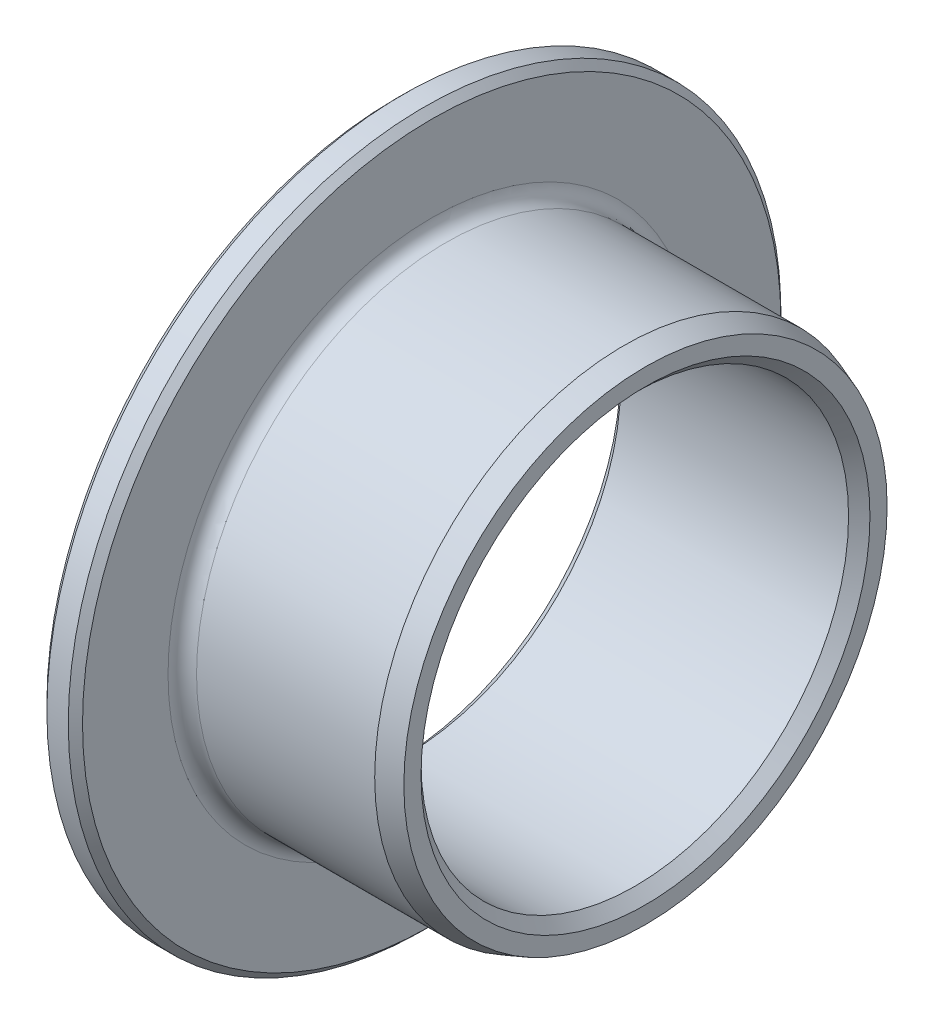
ISO-10303-21;
HEADER;
FILE_DESCRIPTION(('STEP AP214'),'2;1');
FILE_NAME('part.step','',(''),(''),'','','');
FILE_SCHEMA(('AUTOMOTIVE_DESIGN { 1 0 10303 214 1 1 1 1 }'));
ENDSEC;
DATA;
#1=APPLICATION_CONTEXT('core data for automotive mechanical design processes');
#2=APPLICATION_PROTOCOL_DEFINITION('international standard','automotive_design',2000,#1);
#3=PRODUCT_CONTEXT('',#1,'mechanical');
#4=PRODUCT('Part','Part','',(#3));
#5=PRODUCT_RELATED_PRODUCT_CATEGORY('part','',(#4));
#6=PRODUCT_DEFINITION_FORMATION('','',#4);
#7=PRODUCT_DEFINITION_CONTEXT('part definition',#1,'design');
#8=PRODUCT_DEFINITION('design','',#6,#7);
#9=PRODUCT_DEFINITION_SHAPE('','',#8);
#10=(LENGTH_UNIT() NAMED_UNIT(*) SI_UNIT(.MILLI.,.METRE.));
#11=(NAMED_UNIT(*) PLANE_ANGLE_UNIT() SI_UNIT($,.RADIAN.));
#12=(NAMED_UNIT(*) SI_UNIT($,.STERADIAN.) SOLID_ANGLE_UNIT());
#13=UNCERTAINTY_MEASURE_WITH_UNIT(LENGTH_MEASURE(1.E-05),#10,'distance_accuracy_value','');
#14=(GEOMETRIC_REPRESENTATION_CONTEXT(3) GLOBAL_UNCERTAINTY_ASSIGNED_CONTEXT((#13)) GLOBAL_UNIT_ASSIGNED_CONTEXT((#10,
#11,#12)) REPRESENTATION_CONTEXT('',''));
#15=CARTESIAN_POINT('',(0.,0.,0.));
#16=DIRECTION('',(0.,0.,1.));
#17=DIRECTION('',(1.,0.,0.));
#18=AXIS2_PLACEMENT_3D('',#15,#16,#17);
#19=CARTESIAN_POINT('',(0.,10.,0.));
#20=DIRECTION('',(-1.,0.,0.));
#21=DIRECTION('',(0.,0.,1.));
#22=AXIS2_PLACEMENT_3D('',#19,#20,#21);
#23=PLANE('',#22);
#24=CARTESIAN_POINT('',(0.,0.,0.));
#25=DIRECTION('',(-1.,0.,0.));
#26=DIRECTION('',(0.,0.,1.));
#27=AXIS2_PLACEMENT_3D('',#24,#25,#26);
#28=CIRCLE('',#27,7.4);
#29=CARTESIAN_POINT('',(0.,0.,7.4));
#30=VERTEX_POINT('',#29);
#31=EDGE_CURVE('E40',#30,#30,#28,.T.);
#32=ORIENTED_EDGE('',*,*,#31,.T.);
#33=EDGE_LOOP('',(#32));
#34=FACE_BOUND('',#33,.T.);
#35=CARTESIAN_POINT('',(0.,0.,0.));
#36=DIRECTION('',(-1.,0.,0.));
#37=DIRECTION('',(0.,0.,1.));
#38=AXIS2_PLACEMENT_3D('',#35,#36,#37);
#39=CIRCLE('',#38,9.8);
#40=CARTESIAN_POINT('',(0.,0.,9.8));
#41=VERTEX_POINT('',#40);
#42=EDGE_CURVE('E44',#41,#41,#39,.F.);
#43=ORIENTED_EDGE('',*,*,#42,.T.);
#44=EDGE_LOOP('',(#43));
#45=FACE_BOUND('',#44,.T.);
#46=ADVANCED_FACE('F34',(#34,#45),#23,.F.);
#47=CARTESIAN_POINT('',(-5.31268266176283,0.,0.));
#48=DIRECTION('',(-1.,0.,0.));
#49=DIRECTION('',(0.,0.,1.));
#50=AXIS2_PLACEMENT_3D('',#47,#48,#49);
#51=CYLINDRICAL_SURFACE('',#50,7.);
#52=CARTESIAN_POINT('',(0.400000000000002,0.,0.));
#53=DIRECTION('',(-1.,0.,0.));
#54=DIRECTION('',(0.,0.,1.));
#55=AXIS2_PLACEMENT_3D('',#52,#53,#54);
#56=CIRCLE('',#55,7.);
#57=CARTESIAN_POINT('',(0.400000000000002,0.,7.));
#58=VERTEX_POINT('',#57);
#59=EDGE_CURVE('E10',#58,#58,#56,.F.);
#60=ORIENTED_EDGE('',*,*,#59,.T.);
#61=EDGE_LOOP('',(#60));
#62=FACE_BOUND('',#61,.T.);
#63=CARTESIAN_POINT('',(5.4,0.,0.));
#64=DIRECTION('',(-1.,0.,0.));
#65=DIRECTION('',(0.,0.,1.));
#66=AXIS2_PLACEMENT_3D('',#63,#64,#65);
#67=CIRCLE('',#66,7.);
#68=CARTESIAN_POINT('',(5.4,0.,7.));
#69=VERTEX_POINT('',#68);
#70=EDGE_CURVE('E75',#69,#69,#67,.T.);
#71=ORIENTED_EDGE('',*,*,#70,.T.);
#72=EDGE_LOOP('',(#71));
#73=FACE_BOUND('',#72,.T.);
#74=ADVANCED_FACE('F79',(#62,#73),#51,.T.);
#75=CARTESIAN_POINT('',(6.,7.,0.));
#76=DIRECTION('',(-1.,0.,0.));
#77=DIRECTION('',(0.,0.,1.));
#78=AXIS2_PLACEMENT_3D('',#75,#76,#77);
#79=PLANE('',#78);
#80=CARTESIAN_POINT('',(6.,0.,0.));
#81=DIRECTION('',(-1.,0.,0.));
#82=DIRECTION('',(0.,0.,1.));
#83=AXIS2_PLACEMENT_3D('',#80,#81,#82);
#84=CIRCLE('',#83,6.3);
#85=CARTESIAN_POINT('',(6.,0.,6.3));
#86=VERTEX_POINT('',#85);
#87=EDGE_CURVE('E59',#86,#86,#84,.T.);
#88=ORIENTED_EDGE('',*,*,#87,.T.);
#89=EDGE_LOOP('',(#88));
#90=FACE_BOUND('',#89,.T.);
#91=CARTESIAN_POINT('',(6.,0.,0.));
#92=DIRECTION('',(-1.,0.,0.));
#93=DIRECTION('',(0.,0.,1.));
#94=AXIS2_PLACEMENT_3D('',#91,#92,#93);
#95=CIRCLE('',#94,6.78161785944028);
#96=CARTESIAN_POINT('',(6.,0.,6.78161785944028));
#97=VERTEX_POINT('',#96);
#98=EDGE_CURVE('E72',#97,#97,#95,.F.);
#99=ORIENTED_EDGE('',*,*,#98,.T.);
#100=EDGE_LOOP('',(#99));
#101=FACE_BOUND('',#100,.T.);
#102=ADVANCED_FACE('F102',(#90,#101),#79,.F.);
#103=CARTESIAN_POINT('',(-5.31268266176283,0.,0.));
#104=DIRECTION('',(-1.,0.,0.));
#105=DIRECTION('',(0.,0.,1.));
#106=AXIS2_PLACEMENT_3D('',#103,#104,#105);
#107=CYLINDRICAL_SURFACE('',#106,6.);
#108=CARTESIAN_POINT('',(-0.699999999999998,0.,0.));
#109=DIRECTION('',(1.,0.,0.));
#110=DIRECTION('',(0.,0.,-1.));
#111=AXIS2_PLACEMENT_3D('',#108,#109,#110);
#112=CIRCLE('',#111,6.);
#113=CARTESIAN_POINT('',(-0.699999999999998,0.,-6.));
#114=VERTEX_POINT('',#113);
#115=EDGE_CURVE('E66',#114,#114,#112,.F.);
#116=ORIENTED_EDGE('',*,*,#115,.T.);
#117=EDGE_LOOP('',(#116));
#118=FACE_BOUND('',#117,.T.);
#119=CARTESIAN_POINT('',(5.7,0.,0.));
#120=DIRECTION('',(-1.,0.,0.));
#121=DIRECTION('',(0.,0.,1.));
#122=AXIS2_PLACEMENT_3D('',#119,#120,#121);
#123=CIRCLE('',#122,6.);
#124=CARTESIAN_POINT('',(5.7,0.,6.));
#125=VERTEX_POINT('',#124);
#126=EDGE_CURVE('E69',#125,#125,#123,.F.);
#127=ORIENTED_EDGE('',*,*,#126,.T.);
#128=EDGE_LOOP('',(#127));
#129=FACE_BOUND('',#128,.T.);
#130=ADVANCED_FACE('F133',(#118,#129),#107,.F.);
#131=CARTESIAN_POINT('',(-0.999999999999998,6.,0.));
#132=DIRECTION('',(1.,0.,0.));
#133=DIRECTION('',(0.,0.,-1.));
#134=AXIS2_PLACEMENT_3D('',#131,#132,#133);
#135=PLANE('',#134);
#136=CARTESIAN_POINT('',(-0.999999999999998,0.,0.));
#137=DIRECTION('',(1.,0.,0.));
#138=DIRECTION('',(0.,0.,-1.));
#139=AXIS2_PLACEMENT_3D('',#136,#137,#138);
#140=CIRCLE('',#139,9.8);
#141=CARTESIAN_POINT('',(-0.999999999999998,0.,-9.8));
#142=VERTEX_POINT('',#141);
#143=EDGE_CURVE('E56',#142,#142,#140,.F.);
#144=ORIENTED_EDGE('',*,*,#143,.T.);
#145=EDGE_LOOP('',(#144));
#146=FACE_BOUND('',#145,.T.);
#147=CARTESIAN_POINT('',(-0.999999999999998,0.,0.));
#148=DIRECTION('',(1.,0.,0.));
#149=DIRECTION('',(0.,0.,-1.));
#150=AXIS2_PLACEMENT_3D('',#147,#148,#149);
#151=CIRCLE('',#150,6.3);
#152=CARTESIAN_POINT('',(-0.999999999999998,0.,-6.3));
#153=VERTEX_POINT('',#152);
#154=EDGE_CURVE('E62',#153,#153,#151,.T.);
#155=ORIENTED_EDGE('',*,*,#154,.T.);
#156=EDGE_LOOP('',(#155));
#157=FACE_BOUND('',#156,.T.);
#158=ADVANCED_FACE('F94',(#146,#157),#135,.F.);
#159=CARTESIAN_POINT('',(-5.31268266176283,0.,0.));
#160=DIRECTION('',(-1.,0.,0.));
#161=DIRECTION('',(0.,0.,1.));
#162=AXIS2_PLACEMENT_3D('',#159,#160,#161);
#163=CYLINDRICAL_SURFACE('',#162,10.);
#164=CARTESIAN_POINT('',(-0.8,0.,0.));
#165=DIRECTION('',(1.,0.,0.));
#166=DIRECTION('',(0.,0.,-1.));
#167=AXIS2_PLACEMENT_3D('',#164,#165,#166);
#168=CIRCLE('',#167,10.);
#169=CARTESIAN_POINT('',(-0.8,0.,-10.));
#170=VERTEX_POINT('',#169);
#171=EDGE_CURVE('E48',#170,#170,#168,.T.);
#172=ORIENTED_EDGE('',*,*,#171,.T.);
#173=EDGE_LOOP('',(#172));
#174=FACE_BOUND('',#173,.T.);
#175=CARTESIAN_POINT('',(-0.199999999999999,0.,0.));
#176=DIRECTION('',(-1.,0.,0.));
#177=DIRECTION('',(0.,0.,1.));
#178=AXIS2_PLACEMENT_3D('',#175,#176,#177);
#179=CIRCLE('',#178,10.);
#180=CARTESIAN_POINT('',(-0.199999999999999,0.,10.));
#181=VERTEX_POINT('',#180);
#182=EDGE_CURVE('E53',#181,#181,#179,.T.);
#183=ORIENTED_EDGE('',*,*,#182,.T.);
#184=EDGE_LOOP('',(#183));
#185=FACE_BOUND('',#184,.T.);
#186=ADVANCED_FACE('F84',(#174,#185),#163,.T.);
#187=CARTESIAN_POINT('',(5.4,0.,0.));
#188=DIRECTION('',(-1.,0.,0.));
#189=DIRECTION('',(0.,0.,1.));
#190=AXIS2_PLACEMENT_3D('',#187,#188,#189);
#191=CONICAL_SURFACE('',#190,7.,0.349065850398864);
#192=ORIENTED_EDGE('',*,*,#98,.F.);
#193=EDGE_LOOP('',(#192));
#194=FACE_BOUND('',#193,.T.);
#195=ORIENTED_EDGE('',*,*,#70,.F.);
#196=EDGE_LOOP('',(#195));
#197=FACE_BOUND('',#196,.T.);
#198=ADVANCED_FACE('F81',(#194,#197),#191,.T.);
#199=CARTESIAN_POINT('',(-0.699999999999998,0.,0.));
#200=DIRECTION('',(-1.,0.,0.));
#201=DIRECTION('',(0.,0.,1.));
#202=AXIS2_PLACEMENT_3D('',#199,#200,#201);
#203=CONICAL_SURFACE('',#202,6.,0.785398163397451);
#204=ORIENTED_EDGE('',*,*,#154,.F.);
#205=EDGE_LOOP('',(#204));
#206=FACE_BOUND('',#205,.T.);
#207=ORIENTED_EDGE('',*,*,#115,.F.);
#208=EDGE_LOOP('',(#207));
#209=FACE_BOUND('',#208,.T.);
#210=ADVANCED_FACE('F83',(#206,#209),#203,.F.);
#211=CARTESIAN_POINT('',(6.,0.,0.));
#212=DIRECTION('',(1.,0.,0.));
#213=DIRECTION('',(0.,0.,-1.));
#214=AXIS2_PLACEMENT_3D('',#211,#212,#213);
#215=CONICAL_SURFACE('',#214,6.3,0.785398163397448);
#216=ORIENTED_EDGE('',*,*,#126,.F.);
#217=EDGE_LOOP('',(#216));
#218=FACE_BOUND('',#217,.T.);
#219=ORIENTED_EDGE('',*,*,#87,.F.);
#220=EDGE_LOOP('',(#219));
#221=FACE_BOUND('',#220,.T.);
#222=ADVANCED_FACE('F91',(#218,#221),#215,.F.);
#223=CARTESIAN_POINT('',(-0.999999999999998,0.,0.));
#224=DIRECTION('',(1.,0.,0.));
#225=DIRECTION('',(0.,0.,-1.));
#226=AXIS2_PLACEMENT_3D('',#223,#224,#225);
#227=CONICAL_SURFACE('',#226,9.8,0.78539816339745);
#228=ORIENTED_EDGE('',*,*,#171,.F.);
#229=EDGE_LOOP('',(#228));
#230=FACE_BOUND('',#229,.T.);
#231=ORIENTED_EDGE('',*,*,#143,.F.);
#232=EDGE_LOOP('',(#231));
#233=FACE_BOUND('',#232,.T.);
#234=ADVANCED_FACE('F110',(#230,#233),#227,.T.);
#235=CARTESIAN_POINT('',(-0.199999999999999,0.,0.));
#236=DIRECTION('',(-1.,0.,0.));
#237=DIRECTION('',(0.,0.,1.));
#238=AXIS2_PLACEMENT_3D('',#235,#236,#237);
#239=CONICAL_SURFACE('',#238,10.,0.785398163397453);
#240=ORIENTED_EDGE('',*,*,#42,.F.);
#241=EDGE_LOOP('',(#240));
#242=FACE_BOUND('',#241,.T.);
#243=ORIENTED_EDGE('',*,*,#182,.F.);
#244=EDGE_LOOP('',(#243));
#245=FACE_BOUND('',#244,.T.);
#246=ADVANCED_FACE('F106',(#242,#245),#239,.T.);
#247=CARTESIAN_POINT('',(0.400000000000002,0.,0.));
#248=DIRECTION('',(-1.,0.,0.));
#249=DIRECTION('',(0.,0.,1.));
#250=AXIS2_PLACEMENT_3D('',#247,#248,#249);
#251=TOROIDAL_SURFACE('',#250,7.4,0.4);
#252=ORIENTED_EDGE('',*,*,#59,.F.);
#253=EDGE_LOOP('',(#252));
#254=FACE_BOUND('',#253,.T.);
#255=ORIENTED_EDGE('',*,*,#31,.F.);
#256=EDGE_LOOP('',(#255));
#257=FACE_BOUND('',#256,.T.);
#258=ADVANCED_FACE('F109',(#254,#257),#251,.F.);
#259=CLOSED_SHELL('',(#46,#74,#102,#130,#158,#186,#198,#210,#222,#234,#246,#258));
#260=MANIFOLD_SOLID_BREP('B2',#259);
#261=ADVANCED_BREP_SHAPE_REPRESENTATION('',(#18,#260),#14);
#262=SHAPE_DEFINITION_REPRESENTATION(#9,#261);
ENDSEC;
END-ISO-10303-21;
